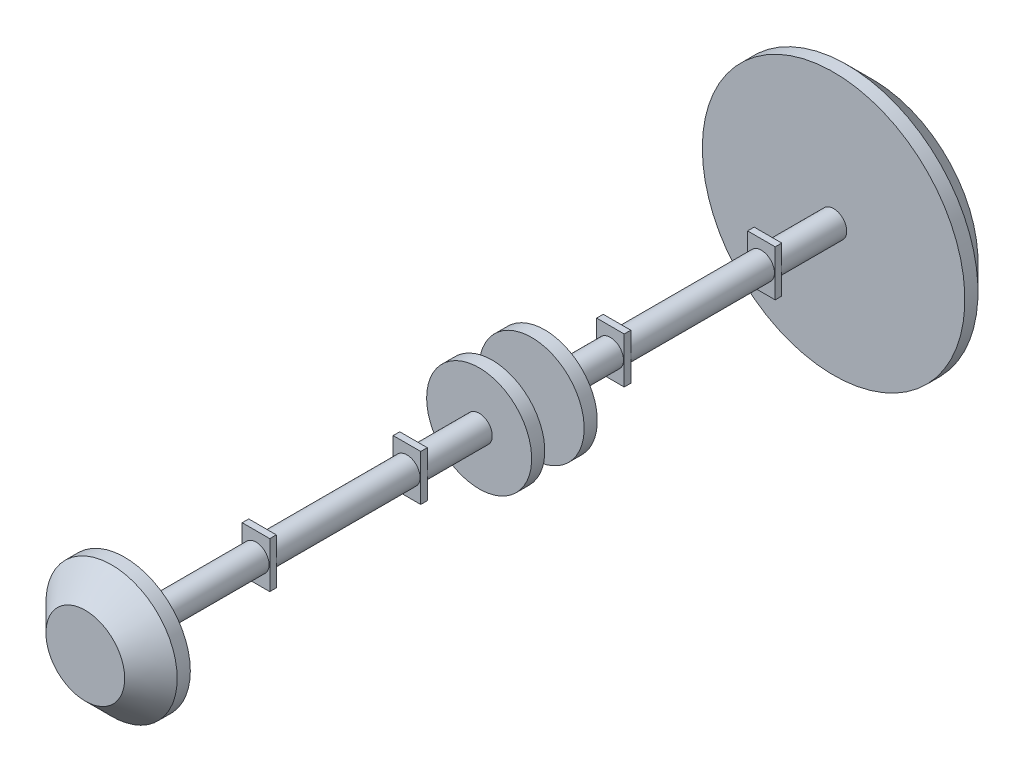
from build123d import *

# Parameters (mm, degrees)
ESQUISSE1_R                  = 10
EXTRUSION1_DEPTH             = 100
ESQUISSE2_W                  = 21
ESQUISSE2_H                  = 35
EXTRUSION2_DEPTH             = 5
EXTRUSION3_START             = 110
ESQUISSE3_R                  = 10
EXTRUSION3_DEPTH             = 110
ESQUISSE4_W                  = 21
ESQUISSE4_H                  = 35
EXTRUSION4_DEPTH             = 5
EXTRUSION5_START             = 50
ESQUISSE5_R                  = 10
EXTRUSION5_DEPTH             = 50
ESQUISSE7_R                  = 50
EXTRUSION7_DEPTH             = 30
CHANFREIN2_SIZE              = 20
ESQUISSE12_R                 = 40
EXTRUSION10_DEPTH            = 10
EXTRUSION11_START            = 30
ESQUISSE13_R                 = 10
EXTRUSION11_DEPTH            = 30
ESQUISSE14_R                 = 40
EXTRUSION12_DEPTH            = 10
EXTRUSION13_START            = 50
ESQUISSE15_R                 = 10
EXTRUSION13_DEPTH            = 50
ENL_V_MAT_EXTRU_1_DEPTH      = 280.105714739
ENL_V_MAT_EXTRU_1_DEPTH_BACK = 280.105714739
ESQUISSE16_W                 = 80
ESQUISSE16_H                 = 30
ESQUISSE17_W                 = 21
ESQUISSE17_H                 = 35
EXTRUSION14_DEPTH            = 5
ESQUISSE18_R                 = 10
EXTRUSION15_DEPTH            = 110
ESQUISSE19_W                 = 21
ESQUISSE19_H                 = 35
EXTRUSION16_DEPTH            = 5
ESQUISSE20_R                 = 10
EXTRUSION17_DEPTH            = 50
ESQUISSE21_R                 = 100
EXTRUSION18_DEPTH            = 30
CHANFREIN3_SIZE              = 20


with BuildPart() as part:
    # Esquisse1 → Extrusion1 (new body)
    with BuildSketch(Plane.XY):
        Circle(ESQUISSE1_R)
    extrude(amount=EXTRUSION1_DEPTH)

    # Esquisse2 → Extrusion2 (add)
    with BuildSketch(Plane(origin=(0, 0, 0), x_dir=(-1, 0, 0), z_dir=(0, 0, -1))):
        Rectangle(ESQUISSE2_W, ESQUISSE2_H)
    extrude(amount=EXTRUSION2_DEPTH)

    # Esquisse3 → Extrusion3 (add)
    with BuildSketch(Plane(origin=(0, 0, -5), x_dir=(-1, 0, 0), z_dir=(0, 0, -1)).offset(EXTRUSION3_START)):
        Circle(ESQUISSE3_R)
    extrude(amount=-EXTRUSION3_DEPTH)

    # Esquisse4 → Extrusion4 (add)
    with BuildSketch(Plane(origin=(0, 0, -115), x_dir=(-1, 0, 0), z_dir=(0, 0, -1))):
        Rectangle(ESQUISSE4_W, ESQUISSE4_H)
    extrude(amount=EXTRUSION4_DEPTH)

    # Esquisse5 → Extrusion5 (add)
    with BuildSketch(Plane(origin=(0, 0, -120), x_dir=(-1, 0, 0), z_dir=(0, 0, -1)).offset(EXTRUSION5_START)):
        Circle(ESQUISSE5_R)
    extrude(amount=-EXTRUSION5_DEPTH)

    # Esquisse7 → Extrusion7 (add)
    with BuildSketch(Plane.XY.offset(100)):
        Circle(ESQUISSE7_R)
    extrude(amount=EXTRUSION7_DEPTH)

    # Chanfrein2
    chanfrein2_edges = [part.edges().sort_by_distance(p)[0] for p in [
        (-50, 0, 130),
    ]]
    chamfer(chanfrein2_edges, length=CHANFREIN2_SIZE)

    # Esquisse12 → Extrusion10 (add)
    with BuildSketch(Plane(origin=(0, 0, -170), x_dir=(-1, 0, 0), z_dir=(0, 0, -1))):
        Circle(ESQUISSE12_R)
    extrude(amount=EXTRUSION10_DEPTH)

    # Esquisse13 → Extrusion11 (add)
    with BuildSketch(Plane(origin=(0, 0, -180), x_dir=(-1, 0, 0), z_dir=(0, 0, -1)).offset(EXTRUSION11_START)):
        Circle(ESQUISSE13_R)
    extrude(amount=-EXTRUSION11_DEPTH)

    # Esquisse14 → Extrusion12 (add)
    with BuildSketch(Plane(origin=(0, 0, -210), x_dir=(-1, 0, 0), z_dir=(0, 0, -1))):
        Circle(ESQUISSE14_R)
    extrude(amount=EXTRUSION12_DEPTH)

    # Esquisse15 → Extrusion13 (add)
    with BuildSketch(Plane(origin=(0, 0, -220), x_dir=(-1, 0, 0), z_dir=(0, 0, -1)).offset(EXTRUSION13_START)):
        Circle(ESQUISSE15_R)
    extrude(amount=-EXTRUSION13_DEPTH)

    # Esquisse16 → Enl_v. mat.-Extru.1 (cut, two sides: drawn at the far end of the back side and taken through both)
    with BuildSketch(Plane(origin=(0, 0, 0), x_dir=(1, 0, 0), z_dir=(0, 1, 0)).offset(-ENL_V_MAT_EXTRU_1_DEPTH_BACK)):
        with Locations((0, 195)):
            Rectangle(ESQUISSE16_W, ESQUISSE16_H)
    extrude(amount=ENL_V_MAT_EXTRU_1_DEPTH + ENL_V_MAT_EXTRU_1_DEPTH_BACK, mode=Mode.SUBTRACT)


with BuildPart() as enl_v_mat_extru_1_piece_1:
    # of the separate pieces the step leaves, piece 1, a body of its own (enl_v_mat_extru_1_pieces)
    add(part.part.solids().sort_by_distance((-40, 0, -180))[0])


with BuildPart() as enl_v_mat_extru_1_piece_2:
    # of the separate pieces the step leaves, piece 2, a body of its own (enl_v_mat_extru_1_pieces)
    add(part.part.solids().sort_by_distance((-40, 0, -210))[0])

    # Esquisse17 → Extrusion14 (add)
    with BuildSketch(Plane(origin=(0, 0, -270), x_dir=(-1, 0, 0), z_dir=(0, 0, -1))):
        Rectangle(ESQUISSE17_W, ESQUISSE17_H)
    extrude(amount=EXTRUSION14_DEPTH)

    # Esquisse18 → Extrusion15 (add)
    with BuildSketch(Plane(origin=(0, 0, -275), x_dir=(-1, 0, 0), z_dir=(0, 0, -1))):
        Circle(ESQUISSE18_R)
    extrude(amount=EXTRUSION15_DEPTH)

    # Esquisse19 → Extrusion16 (add)
    with BuildSketch(Plane(origin=(0, 0, -385), x_dir=(-1, 0, 0), z_dir=(0, 0, -1))):
        Rectangle(ESQUISSE19_W, ESQUISSE19_H)
    extrude(amount=EXTRUSION16_DEPTH)

    # Esquisse20 → Extrusion17 (add)
    with BuildSketch(Plane(origin=(0, 0, -390), x_dir=(-1, 0, 0), z_dir=(0, 0, -1))):
        Circle(ESQUISSE20_R)
    extrude(amount=EXTRUSION17_DEPTH)

    # Esquisse21 → Extrusion18 (add)
    with BuildSketch(Plane(origin=(0, 0, -440), x_dir=(-1, 0, 0), z_dir=(0, 0, -1))):
        Circle(ESQUISSE21_R)
    extrude(amount=EXTRUSION18_DEPTH)

    # Chanfrein3
    chanfrein3_edges = [enl_v_mat_extru_1_piece_2.edges().sort_by_distance(p)[0] for p in [
        (100, 0, -470),
    ]]
    chamfer(chanfrein3_edges, length=CHANFREIN3_SIZE)


solid = Compound([enl_v_mat_extru_1_piece_1.part, enl_v_mat_extru_1_piece_2.part])
